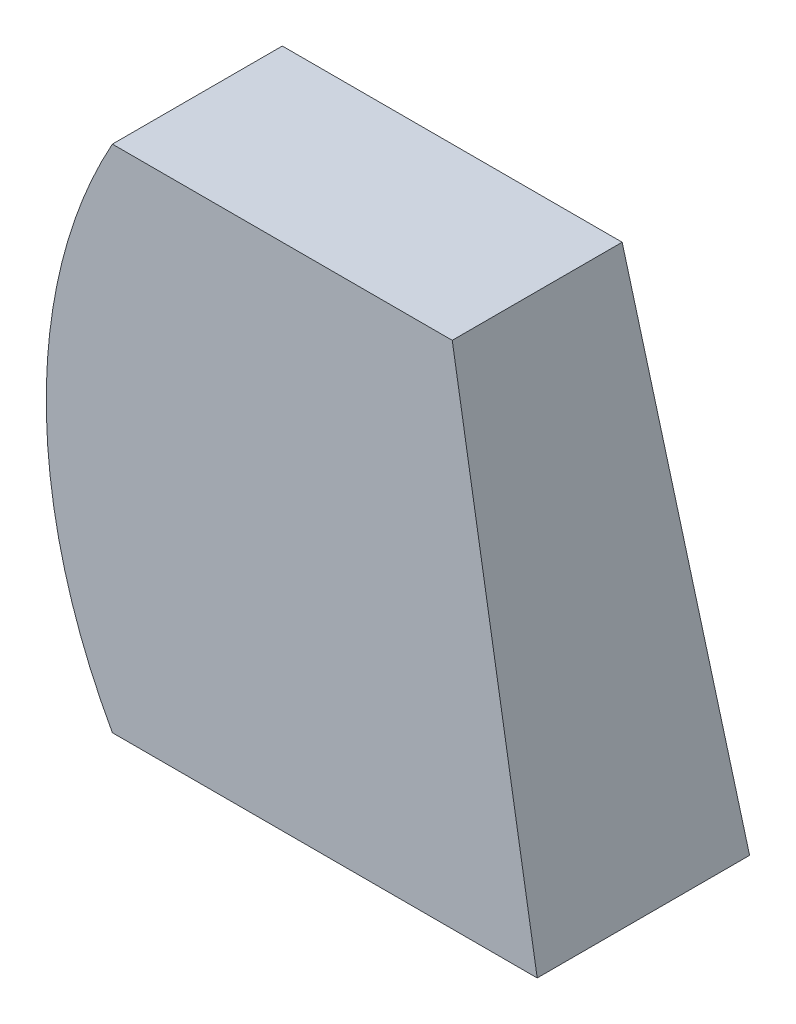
ISO-10303-21;
HEADER;
FILE_DESCRIPTION(('STEP AP214'),'2;1');
FILE_NAME('part.step','',(''),(''),'','','');
FILE_SCHEMA(('AUTOMOTIVE_DESIGN { 1 0 10303 214 1 1 1 1 }'));
ENDSEC;
DATA;
#1=APPLICATION_CONTEXT('core data for automotive mechanical design processes');
#2=APPLICATION_PROTOCOL_DEFINITION('international standard','automotive_design',2000,#1);
#3=PRODUCT_CONTEXT('',#1,'mechanical');
#4=PRODUCT('Part','Part','',(#3));
#5=PRODUCT_RELATED_PRODUCT_CATEGORY('part','',(#4));
#6=PRODUCT_DEFINITION_FORMATION('','',#4);
#7=PRODUCT_DEFINITION_CONTEXT('part definition',#1,'design');
#8=PRODUCT_DEFINITION('design','',#6,#7);
#9=PRODUCT_DEFINITION_SHAPE('','',#8);
#10=(LENGTH_UNIT() NAMED_UNIT(*) SI_UNIT(.MILLI.,.METRE.));
#11=(NAMED_UNIT(*) PLANE_ANGLE_UNIT() SI_UNIT($,.RADIAN.));
#12=(NAMED_UNIT(*) SI_UNIT($,.STERADIAN.) SOLID_ANGLE_UNIT());
#13=UNCERTAINTY_MEASURE_WITH_UNIT(LENGTH_MEASURE(1.E-05),#10,'distance_accuracy_value','');
#14=(GEOMETRIC_REPRESENTATION_CONTEXT(3) GLOBAL_UNCERTAINTY_ASSIGNED_CONTEXT((#13)) GLOBAL_UNIT_ASSIGNED_CONTEXT((#10,
#11,#12)) REPRESENTATION_CONTEXT('',''));
#15=CARTESIAN_POINT('',(0.,0.,0.));
#16=DIRECTION('',(0.,0.,1.));
#17=DIRECTION('',(1.,0.,0.));
#18=AXIS2_PLACEMENT_3D('',#15,#16,#17);
#19=CARTESIAN_POINT('',(0.,152.4,0.));
#20=DIRECTION('',(0.,-1.,0.));
#21=DIRECTION('',(0.,0.,-1.));
#22=AXIS2_PLACEMENT_3D('',#19,#20,#21);
#23=PLANE('',#22);
#24=DIRECTION('',(0.,0.,1.));
#25=VECTOR('',#24,1.);
#26=CARTESIAN_POINT('',(0.,152.4,0.));
#27=LINE('',#26,#25);
#28=CARTESIAN_POINT('',(0.,152.4,-50.8));
#29=VERTEX_POINT('',#28);
#30=CARTESIAN_POINT('',(0.,152.4,0.));
#31=VERTEX_POINT('',#30);
#32=EDGE_CURVE('E179',#29,#31,#27,.T.);
#33=ORIENTED_EDGE('',*,*,#32,.T.);
#34=DIRECTION('',(1.,0.,0.));
#35=VECTOR('',#34,1.);
#36=CARTESIAN_POINT('',(0.,152.4,0.));
#37=LINE('',#36,#35);
#38=CARTESIAN_POINT('',(101.6,152.4,0.));
#39=VERTEX_POINT('',#38);
#40=EDGE_CURVE('E185',#31,#39,#37,.T.);
#41=ORIENTED_EDGE('',*,*,#40,.T.);
#42=DIRECTION('',(0.,0.,-1.));
#43=VECTOR('',#42,1.);
#44=CARTESIAN_POINT('',(101.6,152.4,0.));
#45=LINE('',#44,#43);
#46=CARTESIAN_POINT('',(101.6,152.4,-50.8));
#47=VERTEX_POINT('',#46);
#48=EDGE_CURVE('E191',#39,#47,#45,.T.);
#49=ORIENTED_EDGE('',*,*,#48,.T.);
#50=DIRECTION('',(-1.,0.,0.));
#51=VECTOR('',#50,1.);
#52=CARTESIAN_POINT('',(0.,152.4,-50.8));
#53=LINE('',#52,#51);
#54=EDGE_CURVE('E196',#47,#29,#53,.T.);
#55=ORIENTED_EDGE('',*,*,#54,.T.);
#56=EDGE_LOOP('',(#33,#41,#49,#55));
#57=FACE_BOUND('',#56,.T.);
#58=ADVANCED_FACE('F127',(#57),#23,.F.);
#59=CARTESIAN_POINT('',(0.,0.,-63.5));
#60=DIRECTION('',(0.,-1.,0.));
#61=DIRECTION('',(0.,0.,-1.));
#62=AXIS2_PLACEMENT_3D('',#59,#60,#61);
#63=PLANE('',#62);
#64=DIRECTION('',(0.,0.,1.));
#65=VECTOR('',#64,1.);
#66=CARTESIAN_POINT('',(0.,0.,0.));
#67=LINE('',#66,#65);
#68=CARTESIAN_POINT('',(0.,0.,-63.5));
#69=VERTEX_POINT('',#68);
#70=CARTESIAN_POINT('',(0.,0.,0.));
#71=VERTEX_POINT('',#70);
#72=EDGE_CURVE('E182',#69,#71,#67,.T.);
#73=ORIENTED_EDGE('',*,*,#72,.F.);
#74=DIRECTION('',(-1.,0.,0.));
#75=VECTOR('',#74,1.);
#76=CARTESIAN_POINT('',(0.,0.,-63.5));
#77=LINE('',#76,#75);
#78=CARTESIAN_POINT('',(127.,0.,-63.5));
#79=VERTEX_POINT('',#78);
#80=EDGE_CURVE('E230',#79,#69,#77,.T.);
#81=ORIENTED_EDGE('',*,*,#80,.F.);
#82=DIRECTION('',(0.,0.,-1.));
#83=VECTOR('',#82,1.);
#84=CARTESIAN_POINT('',(127.,0.,0.));
#85=LINE('',#84,#83);
#86=CARTESIAN_POINT('',(127.,0.,0.));
#87=VERTEX_POINT('',#86);
#88=EDGE_CURVE('E139',#87,#79,#85,.T.);
#89=ORIENTED_EDGE('',*,*,#88,.F.);
#90=DIRECTION('',(1.,0.,0.));
#91=VECTOR('',#90,1.);
#92=CARTESIAN_POINT('',(0.,0.,0.));
#93=LINE('',#92,#91);
#94=EDGE_CURVE('E13',#71,#87,#93,.T.);
#95=ORIENTED_EDGE('',*,*,#94,.F.);
#96=EDGE_LOOP('',(#73,#81,#89,#95));
#97=FACE_BOUND('',#96,.T.);
#98=ADVANCED_FACE('F129',(#97),#63,.T.);
#99=CARTESIAN_POINT('',(127.,0.,-63.5));
#100=CARTESIAN_POINT('',(124.720854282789,13.6748743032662,-62.3604271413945));
#101=CARTESIAN_POINT('',(119.586931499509,44.4784110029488,-59.7934657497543));
#102=CARTESIAN_POINT('',(111.120264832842,95.2784110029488,-55.5601324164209));
#103=CARTESIAN_POINT('',(104.932743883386,132.403536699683,-52.4663719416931));
#104=CARTESIAN_POINT('',(101.6,152.4,-50.8));
#105=CARTESIAN_POINT('',(84.6666666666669,0.,-63.5));
#106=CARTESIAN_POINT('',(83.1472361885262,13.9509126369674,-65.3118636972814));
#107=CARTESIAN_POINT('',(79.7246209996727,45.3762434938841,-69.3932035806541));
#108=CARTESIAN_POINT('',(74.0801765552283,92.8724132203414,-47.8272242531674));
#109=CARTESIAN_POINT('',(69.9551625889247,131.561272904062,-49.7593251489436));
#110=CARTESIAN_POINT('',(67.7333333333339,152.4,-50.8));
#111=CARTESIAN_POINT('',(42.3333333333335,0.,-63.5));
#112=CARTESIAN_POINT('',(41.5736180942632,14.2269509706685,-68.2633002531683));
#113=CARTESIAN_POINT('',(39.8623104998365,46.2740759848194,-78.9929414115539));
#114=CARTESIAN_POINT('',(37.0400882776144,90.466415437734,-40.0943160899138));
#115=CARTESIAN_POINT('',(34.9775812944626,130.719009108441,-47.052278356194));
#116=CARTESIAN_POINT('',(33.8666666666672,152.4,-50.8));
#117=CARTESIAN_POINT('',(0.,0.,-63.5));
#118=CARTESIAN_POINT('',(0.,14.5029893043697,-71.2147368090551));
#119=CARTESIAN_POINT('',(0.,47.1719084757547,-88.5926792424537));
#120=CARTESIAN_POINT('',(0.,88.0604176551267,-32.3614079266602));
#121=CARTESIAN_POINT('',(0.,129.87674531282,-44.3452315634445));
#122=CARTESIAN_POINT('',(0.,152.4,-50.8));
#123=B_SPLINE_SURFACE_WITH_KNOTS('',3,3,((#99,#100,#101,#102,#103,#104),(#105,#106,#107,#108,
#109,#110),(#111,#112,#113,#114,#115,#116),(#117,#118,#119,#120,#121,#122)),.UNSPECIFIED.,.F.,
.F.,.F.,(4,4),(4,1,1,4),(0.6,1.),(0.,0.269190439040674,0.606368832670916,1.),.UNSPECIFIED.);
#124=CARTESIAN_POINT('',(0.,0.,-63.5));
#125=CARTESIAN_POINT('',(0.,14.5029893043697,-71.2147368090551));
#126=CARTESIAN_POINT('',(0.,47.1719084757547,-88.5926792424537));
#127=CARTESIAN_POINT('',(0.,88.0604176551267,-32.3614079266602));
#128=CARTESIAN_POINT('',(0.,129.87674531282,-44.3452315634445));
#129=CARTESIAN_POINT('',(0.,152.4,-50.8));
#130=B_SPLINE_CURVE_WITH_KNOTS('',3,(#124,#125,#126,#127,#128,#129),.UNSPECIFIED.,.F.,.F.,(4,1,
1,4),(0.,0.269190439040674,0.606368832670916,1.),.UNSPECIFIED.);
#131=EDGE_CURVE('E245',#69,#29,#130,.T.);
#132=DIRECTION('',(-0.163846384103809,0.983078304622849,0.0819231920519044));
#133=VECTOR('',#132,1.);
#134=CARTESIAN_POINT('',(114.3,76.2,-57.15));
#135=LINE('',#134,#133);
#136=EDGE_CURVE('E247',#79,#47,#135,.T.);
#137=ORIENTED_EDGE('',*,*,#80,.T.);
#138=ORIENTED_EDGE('',*,*,#131,.T.);
#139=ORIENTED_EDGE('',*,*,#54,.F.);
#140=ORIENTED_EDGE('',*,*,#136,.F.);
#141=EDGE_LOOP('',(#137,#138,#139,#140));
#142=FACE_BOUND('',#141,.T.);
#143=ADVANCED_FACE('F244',(#142),#123,.T.);
#144=CARTESIAN_POINT('',(127.,0.,0.));
#145=DIRECTION('',(0.986393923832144,0.164398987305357,0.));
#146=DIRECTION('',(0.,0.,-1.));
#147=AXIS2_PLACEMENT_3D('',#144,#145,#146);
#148=PLANE('',#147);
#149=ORIENTED_EDGE('',*,*,#88,.T.);
#150=ORIENTED_EDGE('',*,*,#136,.T.);
#151=ORIENTED_EDGE('',*,*,#48,.F.);
#152=DIRECTION('',(-0.164398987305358,0.986393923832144,0.));
#153=VECTOR('',#152,1.);
#154=CARTESIAN_POINT('',(114.3,76.2,0.));
#155=LINE('',#154,#153);
#156=EDGE_CURVE('E147',#87,#39,#155,.T.);
#157=ORIENTED_EDGE('',*,*,#156,.F.);
#158=EDGE_LOOP('',(#149,#150,#151,#157));
#159=FACE_BOUND('',#158,.T.);
#160=ADVANCED_FACE('F327',(#159),#148,.T.);
#161=CARTESIAN_POINT('',(0.,0.,0.));
#162=DIRECTION('',(0.,0.,1.));
#163=DIRECTION('',(1.,0.,0.));
#164=AXIS2_PLACEMENT_3D('',#161,#162,#163);
#165=PLANE('',#164);
#166=ORIENTED_EDGE('',*,*,#94,.T.);
#167=ORIENTED_EDGE('',*,*,#156,.T.);
#168=ORIENTED_EDGE('',*,*,#40,.F.);
#169=CARTESIAN_POINT('',(0.,0.,0.));
#170=CARTESIAN_POINT('',(-7.09584858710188,12.7525794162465,0.));
#171=CARTESIAN_POINT('',(-18.777003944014,43.1563399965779,0.));
#172=CARTESIAN_POINT('',(-22.0572562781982,96.1741256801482,0.));
#173=CARTESIAN_POINT('',(-10.3761009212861,133.752187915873,0.));
#174=CARTESIAN_POINT('',(0.,152.4,0.));
#175=B_SPLINE_CURVE_WITH_KNOTS('',3,(#169,#170,#171,#172,#173,#174),.UNSPECIFIED.,.F.,.F.,(4,1,
1,4),(0.,0.269190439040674,0.606368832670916,1.),.UNSPECIFIED.);
#176=EDGE_CURVE('E174',#71,#31,#175,.T.);
#177=ORIENTED_EDGE('',*,*,#176,.F.);
#178=EDGE_LOOP('',(#166,#167,#168,#177));
#179=FACE_BOUND('',#178,.T.);
#180=ADVANCED_FACE('F188',(#179),#165,.T.);
#181=CARTESIAN_POINT('',(0.,0.,-63.5));
#182=CARTESIAN_POINT('',(0.,14.5029893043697,-71.2147368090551));
#183=CARTESIAN_POINT('',(0.,47.1719084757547,-88.5926792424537));
#184=CARTESIAN_POINT('',(0.,88.0604176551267,-32.3614079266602));
#185=CARTESIAN_POINT('',(0.,129.87674531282,-44.3452315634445));
#186=CARTESIAN_POINT('',(0.,152.4,-50.8));
#187=CARTESIAN_POINT('',(0.,0.,-42.3333333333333));
#188=CARTESIAN_POINT('',(-2.36528286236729,13.919519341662,-47.4764912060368));
#189=CARTESIAN_POINT('',(-6.25900131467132,45.8333856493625,-59.0617861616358));
#190=CARTESIAN_POINT('',(-7.3524187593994,90.7649869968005,-21.5742719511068));
#191=CARTESIAN_POINT('',(-3.45870030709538,131.168559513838,-29.563487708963));
#192=CARTESIAN_POINT('',(0.,152.4,-33.8666666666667));
#193=CARTESIAN_POINT('',(0.,0.,-21.1666666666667));
#194=CARTESIAN_POINT('',(-4.73056572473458,13.3360493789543,-23.7382456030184));
#195=CARTESIAN_POINT('',(-12.5180026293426,44.4948628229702,-29.5308930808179));
#196=CARTESIAN_POINT('',(-14.7048375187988,93.4695563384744,-10.7871359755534));
#197=CARTESIAN_POINT('',(-6.91740061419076,132.460373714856,-14.7817438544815));
#198=CARTESIAN_POINT('',(0.,152.4,-16.9333333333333));
#199=CARTESIAN_POINT('',(0.,0.,0.));
#200=CARTESIAN_POINT('',(-7.09584858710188,12.7525794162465,0.));
#201=CARTESIAN_POINT('',(-18.777003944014,43.1563399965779,0.));
#202=CARTESIAN_POINT('',(-22.0572562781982,96.1741256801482,0.));
#203=CARTESIAN_POINT('',(-10.3761009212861,133.752187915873,0.));
#204=CARTESIAN_POINT('',(0.,152.4,0.));
#205=B_SPLINE_SURFACE_WITH_KNOTS('',3,3,((#181,#182,#183,#184,#185,#186),(#187,#188,#189,#190,
#191,#192),(#193,#194,#195,#196,#197,#198),(#199,#200,#201,#202,#203,#204)),.UNSPECIFIED.,.F.,
.F.,.F.,(4,4),(4,1,1,4),(0.,1.),(0.,0.269190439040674,0.606368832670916,1.),.UNSPECIFIED.);
#206=ORIENTED_EDGE('',*,*,#72,.T.);
#207=ORIENTED_EDGE('',*,*,#176,.T.);
#208=ORIENTED_EDGE('',*,*,#32,.F.);
#209=ORIENTED_EDGE('',*,*,#131,.F.);
#210=EDGE_LOOP('',(#206,#207,#208,#209));
#211=FACE_BOUND('',#210,.T.);
#212=ADVANCED_FACE('F176',(#211),#205,.T.);
#213=CLOSED_SHELL('',(#58,#98,#143,#160,#180,#212));
#214=MANIFOLD_SOLID_BREP('B2',#213);
#215=ADVANCED_BREP_SHAPE_REPRESENTATION('',(#18,#214),#14);
#216=SHAPE_DEFINITION_REPRESENTATION(#9,#215);
ENDSEC;
END-ISO-10303-21;
